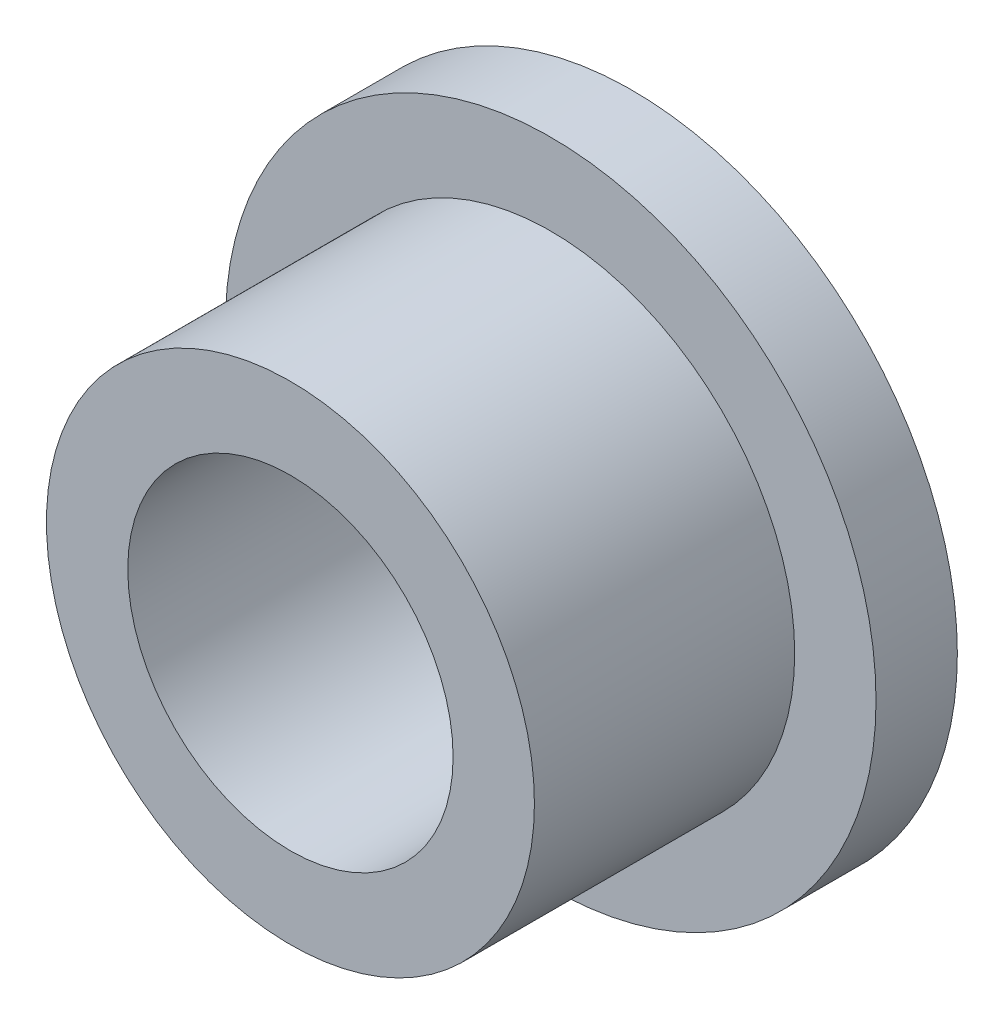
ISO-10303-21;
HEADER;
FILE_DESCRIPTION(('STEP AP214'),'2;1');
FILE_NAME('part.step','',(''),(''),'','','');
FILE_SCHEMA(('AUTOMOTIVE_DESIGN { 1 0 10303 214 1 1 1 1 }'));
ENDSEC;
DATA;
#1=APPLICATION_CONTEXT('core data for automotive mechanical design processes');
#2=APPLICATION_PROTOCOL_DEFINITION('international standard','automotive_design',2000,#1);
#3=PRODUCT_CONTEXT('',#1,'mechanical');
#4=PRODUCT('Part','Part','',(#3));
#5=PRODUCT_RELATED_PRODUCT_CATEGORY('part','',(#4));
#6=PRODUCT_DEFINITION_FORMATION('','',#4);
#7=PRODUCT_DEFINITION_CONTEXT('part definition',#1,'design');
#8=PRODUCT_DEFINITION('design','',#6,#7);
#9=PRODUCT_DEFINITION_SHAPE('','',#8);
#10=(LENGTH_UNIT() NAMED_UNIT(*) SI_UNIT(.MILLI.,.METRE.));
#11=(NAMED_UNIT(*) PLANE_ANGLE_UNIT() SI_UNIT($,.RADIAN.));
#12=(NAMED_UNIT(*) SI_UNIT($,.STERADIAN.) SOLID_ANGLE_UNIT());
#13=UNCERTAINTY_MEASURE_WITH_UNIT(LENGTH_MEASURE(1.E-05),#10,'distance_accuracy_value','');
#14=(GEOMETRIC_REPRESENTATION_CONTEXT(3) GLOBAL_UNCERTAINTY_ASSIGNED_CONTEXT((#13)) GLOBAL_UNIT_ASSIGNED_CONTEXT((#10,
#11,#12)) REPRESENTATION_CONTEXT('',''));
#15=CARTESIAN_POINT('',(0.,0.,0.));
#16=DIRECTION('',(0.,0.,1.));
#17=DIRECTION('',(1.,0.,0.));
#18=AXIS2_PLACEMENT_3D('',#15,#16,#17);
#19=CARTESIAN_POINT('',(0.,0.,1.5875));
#20=DIRECTION('',(0.,0.,1.));
#21=DIRECTION('',(1.,0.,0.));
#22=AXIS2_PLACEMENT_3D('',#19,#20,#21);
#23=PLANE('',#22);
#24=CARTESIAN_POINT('',(0.,0.,1.5875));
#25=DIRECTION('',(0.,0.,1.));
#26=DIRECTION('',(1.,0.,0.));
#27=AXIS2_PLACEMENT_3D('',#24,#25,#26);
#28=CIRCLE('',#27,6.35);
#29=CARTESIAN_POINT('',(6.35,0.,1.5875));
#30=VERTEX_POINT('',#29);
#31=EDGE_CURVE('E10',#30,#30,#28,.T.);
#32=ORIENTED_EDGE('',*,*,#31,.T.);
#33=EDGE_LOOP('',(#32));
#34=FACE_BOUND('',#33,.T.);
#35=CARTESIAN_POINT('',(0.,0.,1.5875));
#36=DIRECTION('',(0.,0.,1.));
#37=DIRECTION('',(1.,0.,0.));
#38=AXIS2_PLACEMENT_3D('',#35,#36,#37);
#39=CIRCLE('',#38,4.7625);
#40=CARTESIAN_POINT('',(4.7625,0.,1.5875));
#41=VERTEX_POINT('',#40);
#42=EDGE_CURVE('E44',#41,#41,#39,.T.);
#43=ORIENTED_EDGE('',*,*,#42,.F.);
#44=EDGE_LOOP('',(#43));
#45=FACE_BOUND('',#44,.T.);
#46=ADVANCED_FACE('F31',(#34,#45),#23,.T.);
#47=CARTESIAN_POINT('',(0.,0.,1.5875));
#48=DIRECTION('',(0.,0.,-1.));
#49=DIRECTION('',(-1.,0.,0.));
#50=AXIS2_PLACEMENT_3D('',#47,#48,#49);
#51=CYLINDRICAL_SURFACE('',#50,6.35);
#52=ORIENTED_EDGE('',*,*,#31,.F.);
#53=EDGE_LOOP('',(#52));
#54=FACE_BOUND('',#53,.T.);
#55=CARTESIAN_POINT('',(0.,0.,0.));
#56=DIRECTION('',(0.,0.,1.));
#57=DIRECTION('',(1.,0.,0.));
#58=AXIS2_PLACEMENT_3D('',#55,#56,#57);
#59=CIRCLE('',#58,6.35);
#60=CARTESIAN_POINT('',(6.35,0.,0.));
#61=VERTEX_POINT('',#60);
#62=EDGE_CURVE('E35',#61,#61,#59,.T.);
#63=ORIENTED_EDGE('',*,*,#62,.T.);
#64=EDGE_LOOP('',(#63));
#65=FACE_BOUND('',#64,.T.);
#66=ADVANCED_FACE('F33',(#54,#65),#51,.T.);
#67=CARTESIAN_POINT('',(0.,0.,0.));
#68=DIRECTION('',(0.,0.,1.));
#69=DIRECTION('',(1.,0.,0.));
#70=AXIS2_PLACEMENT_3D('',#67,#68,#69);
#71=PLANE('',#70);
#72=CARTESIAN_POINT('',(0.,0.,0.));
#73=DIRECTION('',(0.,0.,1.));
#74=DIRECTION('',(1.,0.,0.));
#75=AXIS2_PLACEMENT_3D('',#72,#73,#74);
#76=CIRCLE('',#75,3.175);
#77=CARTESIAN_POINT('',(3.175,0.,0.));
#78=VERTEX_POINT('',#77);
#79=EDGE_CURVE('E47',#78,#78,#76,.T.);
#80=ORIENTED_EDGE('',*,*,#79,.T.);
#81=EDGE_LOOP('',(#80));
#82=FACE_BOUND('',#81,.T.);
#83=ORIENTED_EDGE('',*,*,#62,.F.);
#84=EDGE_LOOP('',(#83));
#85=FACE_BOUND('',#84,.T.);
#86=ADVANCED_FACE('F56',(#82,#85),#71,.F.);
#87=CARTESIAN_POINT('',(0.,0.,6.6675));
#88=DIRECTION('',(0.,0.,-1.));
#89=DIRECTION('',(-1.,0.,0.));
#90=AXIS2_PLACEMENT_3D('',#87,#88,#89);
#91=CYLINDRICAL_SURFACE('',#90,4.7625);
#92=CARTESIAN_POINT('',(0.,0.,6.6675));
#93=DIRECTION('',(0.,0.,1.));
#94=DIRECTION('',(1.,0.,0.));
#95=AXIS2_PLACEMENT_3D('',#92,#93,#94);
#96=CIRCLE('',#95,4.7625);
#97=CARTESIAN_POINT('',(4.7625,0.,6.6675));
#98=VERTEX_POINT('',#97);
#99=EDGE_CURVE('E42',#98,#98,#96,.T.);
#100=ORIENTED_EDGE('',*,*,#99,.F.);
#101=EDGE_LOOP('',(#100));
#102=FACE_BOUND('',#101,.T.);
#103=ORIENTED_EDGE('',*,*,#42,.T.);
#104=EDGE_LOOP('',(#103));
#105=FACE_BOUND('',#104,.T.);
#106=ADVANCED_FACE('F68',(#102,#105),#91,.T.);
#107=CARTESIAN_POINT('',(0.,0.,6.6675));
#108=DIRECTION('',(0.,0.,1.));
#109=DIRECTION('',(1.,0.,0.));
#110=AXIS2_PLACEMENT_3D('',#107,#108,#109);
#111=PLANE('',#110);
#112=CARTESIAN_POINT('',(0.,0.,6.6675));
#113=DIRECTION('',(0.,0.,1.));
#114=DIRECTION('',(1.,0.,0.));
#115=AXIS2_PLACEMENT_3D('',#112,#113,#114);
#116=CIRCLE('',#115,3.175);
#117=CARTESIAN_POINT('',(3.175,0.,6.6675));
#118=VERTEX_POINT('',#117);
#119=EDGE_CURVE('E50',#118,#118,#116,.T.);
#120=ORIENTED_EDGE('',*,*,#119,.F.);
#121=EDGE_LOOP('',(#120));
#122=FACE_BOUND('',#121,.T.);
#123=ORIENTED_EDGE('',*,*,#99,.T.);
#124=EDGE_LOOP('',(#123));
#125=FACE_BOUND('',#124,.T.);
#126=ADVANCED_FACE('F62',(#122,#125),#111,.T.);
#127=CARTESIAN_POINT('',(0.,0.,0.));
#128=DIRECTION('',(0.,0.,1.));
#129=DIRECTION('',(1.,0.,0.));
#130=AXIS2_PLACEMENT_3D('',#127,#128,#129);
#131=CYLINDRICAL_SURFACE('',#130,3.175);
#132=ORIENTED_EDGE('',*,*,#79,.F.);
#133=EDGE_LOOP('',(#132));
#134=FACE_BOUND('',#133,.T.);
#135=ORIENTED_EDGE('',*,*,#119,.T.);
#136=EDGE_LOOP('',(#135));
#137=FACE_BOUND('',#136,.T.);
#138=ADVANCED_FACE('F59',(#134,#137),#131,.F.);
#139=CLOSED_SHELL('',(#46,#66,#86,#106,#126,#138));
#140=MANIFOLD_SOLID_BREP('B2',#139);
#141=ADVANCED_BREP_SHAPE_REPRESENTATION('',(#18,#140),#14);
#142=SHAPE_DEFINITION_REPRESENTATION(#9,#141);
ENDSEC;
END-ISO-10303-21;
